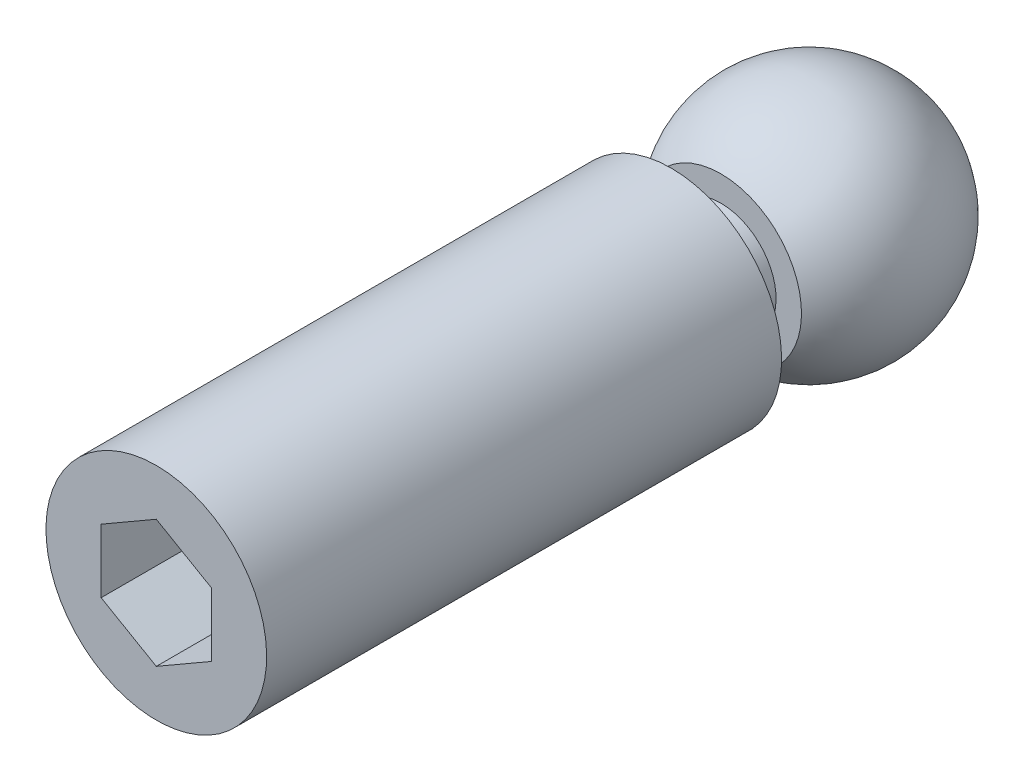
ISO-10303-21;
HEADER;
FILE_DESCRIPTION(('STEP AP214'),'2;1');
FILE_NAME('part.step','',(''),(''),'','','');
FILE_SCHEMA(('AUTOMOTIVE_DESIGN { 1 0 10303 214 1 1 1 1 }'));
ENDSEC;
DATA;
#1=APPLICATION_CONTEXT('core data for automotive mechanical design processes');
#2=APPLICATION_PROTOCOL_DEFINITION('international standard','automotive_design',2000,#1);
#3=PRODUCT_CONTEXT('',#1,'mechanical');
#4=PRODUCT('Part','Part','',(#3));
#5=PRODUCT_RELATED_PRODUCT_CATEGORY('part','',(#4));
#6=PRODUCT_DEFINITION_FORMATION('','',#4);
#7=PRODUCT_DEFINITION_CONTEXT('part definition',#1,'design');
#8=PRODUCT_DEFINITION('design','',#6,#7);
#9=PRODUCT_DEFINITION_SHAPE('','',#8);
#10=(LENGTH_UNIT() NAMED_UNIT(*) SI_UNIT(.MILLI.,.METRE.));
#11=(NAMED_UNIT(*) PLANE_ANGLE_UNIT() SI_UNIT($,.RADIAN.));
#12=(NAMED_UNIT(*) SI_UNIT($,.STERADIAN.) SOLID_ANGLE_UNIT());
#13=UNCERTAINTY_MEASURE_WITH_UNIT(LENGTH_MEASURE(1.E-05),#10,'distance_accuracy_value','');
#14=(GEOMETRIC_REPRESENTATION_CONTEXT(3) GLOBAL_UNCERTAINTY_ASSIGNED_CONTEXT((#13)) GLOBAL_UNIT_ASSIGNED_CONTEXT((#10,
#11,#12)) REPRESENTATION_CONTEXT('',''));
#15=CARTESIAN_POINT('',(0.,0.,0.));
#16=DIRECTION('',(0.,0.,1.));
#17=DIRECTION('',(1.,0.,0.));
#18=AXIS2_PLACEMENT_3D('',#15,#16,#17);
#19=CARTESIAN_POINT('',(0.,0.,6.5));
#20=DIRECTION('',(0.,-1.,0.));
#21=DIRECTION('',(-1.,0.,0.));
#22=AXIS2_PLACEMENT_3D('',#19,#20,#21);
#23=SPHERICAL_SURFACE('',#22,6.5);
#24=CARTESIAN_POINT('',(0.,0.,6.5));
#25=DIRECTION('',(0.,0.,1.));
#26=DIRECTION('',(0.,1.,0.));
#27=AXIS2_PLACEMENT_3D('',#24,#25,#26);
#28=SPHERICAL_SURFACE('',#27,6.5);
#29=CARTESIAN_POINT('',(0.,0.,11.3));
#30=DIRECTION('',(0.,0.,1.));
#31=DIRECTION('',(0.,1.,0.));
#32=AXIS2_PLACEMENT_3D('',#29,#30,#31);
#33=CIRCLE('',#32,4.38292140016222);
#34=CARTESIAN_POINT('',(0.,4.38292140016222,11.3));
#35=VERTEX_POINT('',#34);
#36=EDGE_CURVE('E9',#35,#35,#33,.T.);
#37=ORIENTED_EDGE('',*,*,#36,.F.);
#38=EDGE_LOOP('',(#37));
#39=FACE_BOUND('',#38,.T.);
#40=ADVANCED_FACE('F14',(#39),#28,.T.);
#41=CARTESIAN_POINT('',(0.,-4.38292140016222,11.3));
#42=DIRECTION('',(0.,0.,-1.));
#43=DIRECTION('',(0.,-1.,0.));
#44=AXIS2_PLACEMENT_3D('',#41,#42,#43);
#45=PLANE('',#44);
#46=CARTESIAN_POINT('',(0.,0.,11.3));
#47=DIRECTION('',(0.,0.,1.));
#48=DIRECTION('',(0.,1.,0.));
#49=AXIS2_PLACEMENT_3D('',#46,#47,#48);
#50=CIRCLE('',#49,3.);
#51=CARTESIAN_POINT('',(0.,3.,11.3));
#52=VERTEX_POINT('',#51);
#53=EDGE_CURVE('E21',#52,#52,#50,.T.);
#54=ORIENTED_EDGE('',*,*,#53,.F.);
#55=EDGE_LOOP('',(#54));
#56=FACE_BOUND('',#55,.T.);
#57=ORIENTED_EDGE('',*,*,#36,.T.);
#58=EDGE_LOOP('',(#57));
#59=FACE_BOUND('',#58,.T.);
#60=ADVANCED_FACE('F134',(#56,#59),#45,.F.);
#61=CARTESIAN_POINT('',(0.,0.,8.3));
#62=DIRECTION('',(0.,0.,1.));
#63=DIRECTION('',(0.,1.,0.));
#64=AXIS2_PLACEMENT_3D('',#61,#62,#63);
#65=CYLINDRICAL_SURFACE('',#64,3.);
#66=ORIENTED_EDGE('',*,*,#53,.T.);
#67=EDGE_LOOP('',(#66));
#68=FACE_BOUND('',#67,.T.);
#69=CARTESIAN_POINT('',(0.,0.,14.));
#70=DIRECTION('',(0.,0.,1.));
#71=DIRECTION('',(0.,1.,0.));
#72=AXIS2_PLACEMENT_3D('',#69,#70,#71);
#73=CIRCLE('',#72,3.);
#74=CARTESIAN_POINT('',(0.,3.,14.));
#75=VERTEX_POINT('',#74);
#76=EDGE_CURVE('E126',#75,#75,#73,.T.);
#77=ORIENTED_EDGE('',*,*,#76,.F.);
#78=EDGE_LOOP('',(#77));
#79=FACE_BOUND('',#78,.T.);
#80=ADVANCED_FACE('F131',(#68,#79),#65,.T.);
#81=CARTESIAN_POINT('',(0.,-6.,14.));
#82=DIRECTION('',(0.,0.,-1.));
#83=DIRECTION('',(0.,-1.,0.));
#84=AXIS2_PLACEMENT_3D('',#81,#82,#83);
#85=PLANE('',#84);
#86=ORIENTED_EDGE('',*,*,#76,.T.);
#87=EDGE_LOOP('',(#86));
#88=FACE_BOUND('',#87,.T.);
#89=CARTESIAN_POINT('',(0.,0.,14.));
#90=DIRECTION('',(0.,0.,1.));
#91=DIRECTION('',(0.,1.,0.));
#92=AXIS2_PLACEMENT_3D('',#89,#90,#91);
#93=CIRCLE('',#92,6.);
#94=CARTESIAN_POINT('',(0.,6.,14.));
#95=VERTEX_POINT('',#94);
#96=EDGE_CURVE('E123',#95,#95,#93,.T.);
#97=ORIENTED_EDGE('',*,*,#96,.F.);
#98=EDGE_LOOP('',(#97));
#99=FACE_BOUND('',#98,.T.);
#100=ADVANCED_FACE('F157',(#88,#99),#85,.T.);
#101=CARTESIAN_POINT('',(0.,0.,8.3));
#102=DIRECTION('',(0.,0.,1.));
#103=DIRECTION('',(0.,1.,0.));
#104=AXIS2_PLACEMENT_3D('',#101,#102,#103);
#105=CYLINDRICAL_SURFACE('',#104,6.);
#106=ORIENTED_EDGE('',*,*,#96,.T.);
#107=EDGE_LOOP('',(#106));
#108=FACE_BOUND('',#107,.T.);
#109=CARTESIAN_POINT('',(0.,0.,42.));
#110=DIRECTION('',(0.,0.,1.));
#111=DIRECTION('',(0.,1.,0.));
#112=AXIS2_PLACEMENT_3D('',#109,#110,#111);
#113=CIRCLE('',#112,6.);
#114=CARTESIAN_POINT('',(0.,6.,42.));
#115=VERTEX_POINT('',#114);
#116=EDGE_CURVE('E115',#115,#115,#113,.T.);
#117=ORIENTED_EDGE('',*,*,#116,.F.);
#118=EDGE_LOOP('',(#117));
#119=FACE_BOUND('',#118,.T.);
#120=ADVANCED_FACE('F165',(#108,#119),#105,.T.);
#121=CARTESIAN_POINT('',(0.,0.,42.));
#122=DIRECTION('',(0.,0.,1.));
#123=DIRECTION('',(0.,1.,0.));
#124=AXIS2_PLACEMENT_3D('',#121,#122,#123);
#125=PLANE('',#124);
#126=DIRECTION('',(-0.866025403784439,0.5,0.));
#127=VECTOR('',#126,1.);
#128=CARTESIAN_POINT('',(3.,1.73205080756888,42.));
#129=LINE('',#128,#127);
#130=CARTESIAN_POINT('',(3.,1.73205080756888,42.));
#131=VERTEX_POINT('',#130);
#132=CARTESIAN_POINT('',(0.,3.46410161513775,42.));
#133=VERTEX_POINT('',#132);
#134=EDGE_CURVE('E28',#131,#133,#129,.T.);
#135=ORIENTED_EDGE('',*,*,#134,.F.);
#136=DIRECTION('',(0.,1.,0.));
#137=VECTOR('',#136,1.);
#138=CARTESIAN_POINT('',(3.,-1.73205080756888,42.));
#139=LINE('',#138,#137);
#140=CARTESIAN_POINT('',(3.,-1.73205080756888,42.));
#141=VERTEX_POINT('',#140);
#142=EDGE_CURVE('E111',#141,#131,#139,.T.);
#143=ORIENTED_EDGE('',*,*,#142,.F.);
#144=DIRECTION('',(0.866025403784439,0.5,0.));
#145=VECTOR('',#144,1.);
#146=CARTESIAN_POINT('',(0.,-3.46410161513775,42.));
#147=LINE('',#146,#145);
#148=CARTESIAN_POINT('',(0.,-3.46410161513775,42.));
#149=VERTEX_POINT('',#148);
#150=EDGE_CURVE('E109',#149,#141,#147,.T.);
#151=ORIENTED_EDGE('',*,*,#150,.F.);
#152=DIRECTION('',(0.866025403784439,-0.5,0.));
#153=VECTOR('',#152,1.);
#154=CARTESIAN_POINT('',(-3.,-1.73205080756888,42.));
#155=LINE('',#154,#153);
#156=CARTESIAN_POINT('',(-3.,-1.73205080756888,42.));
#157=VERTEX_POINT('',#156);
#158=EDGE_CURVE('E76',#157,#149,#155,.T.);
#159=ORIENTED_EDGE('',*,*,#158,.F.);
#160=DIRECTION('',(0.,-1.,0.));
#161=VECTOR('',#160,1.);
#162=CARTESIAN_POINT('',(-3.,1.73205080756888,42.));
#163=LINE('',#162,#161);
#164=CARTESIAN_POINT('',(-3.,1.73205080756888,42.));
#165=VERTEX_POINT('',#164);
#166=EDGE_CURVE('E105',#165,#157,#163,.T.);
#167=ORIENTED_EDGE('',*,*,#166,.F.);
#168=DIRECTION('',(-0.866025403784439,-0.5,0.));
#169=VECTOR('',#168,1.);
#170=CARTESIAN_POINT('',(0.,3.46410161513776,42.));
#171=LINE('',#170,#169);
#172=EDGE_CURVE('E102',#133,#165,#171,.T.);
#173=ORIENTED_EDGE('',*,*,#172,.F.);
#174=EDGE_LOOP('',(#135,#143,#151,#159,#167,#173));
#175=FACE_BOUND('',#174,.T.);
#176=ORIENTED_EDGE('',*,*,#116,.T.);
#177=EDGE_LOOP('',(#176));
#178=FACE_BOUND('',#177,.T.);
#179=ADVANCED_FACE('F174',(#175,#178),#125,.T.);
#180=CARTESIAN_POINT('',(3.,1.73205080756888,34.));
#181=DIRECTION('',(0.5,0.866025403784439,0.));
#182=DIRECTION('',(-0.866025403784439,0.5,0.));
#183=AXIS2_PLACEMENT_3D('',#180,#181,#182);
#184=PLANE('',#183);
#185=ORIENTED_EDGE('',*,*,#134,.T.);
#186=DIRECTION('',(0.,0.,1.));
#187=VECTOR('',#186,1.);
#188=CARTESIAN_POINT('',(0.,3.46410161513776,34.));
#189=LINE('',#188,#187);
#190=CARTESIAN_POINT('',(0.,3.46410161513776,34.));
#191=VERTEX_POINT('',#190);
#192=EDGE_CURVE('E58',#191,#133,#189,.T.);
#193=ORIENTED_EDGE('',*,*,#192,.F.);
#194=DIRECTION('',(-0.866025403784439,0.5,0.));
#195=VECTOR('',#194,1.);
#196=CARTESIAN_POINT('',(3.,1.73205080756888,34.));
#197=LINE('',#196,#195);
#198=CARTESIAN_POINT('',(3.,1.73205080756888,34.));
#199=VERTEX_POINT('',#198);
#200=EDGE_CURVE('E113',#199,#191,#197,.T.);
#201=ORIENTED_EDGE('',*,*,#200,.F.);
#202=DIRECTION('',(0.,0.,1.));
#203=VECTOR('',#202,1.);
#204=CARTESIAN_POINT('',(3.,1.73205080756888,34.));
#205=LINE('',#204,#203);
#206=EDGE_CURVE('E36',#199,#131,#205,.T.);
#207=ORIENTED_EDGE('',*,*,#206,.T.);
#208=EDGE_LOOP('',(#185,#193,#201,#207));
#209=FACE_BOUND('',#208,.T.);
#210=ADVANCED_FACE('F183',(#209),#184,.F.);
#211=CARTESIAN_POINT('',(3.,-1.73205080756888,34.));
#212=DIRECTION('',(1.,0.,0.));
#213=DIRECTION('',(0.,0.,-1.));
#214=AXIS2_PLACEMENT_3D('',#211,#212,#213);
#215=PLANE('',#214);
#216=ORIENTED_EDGE('',*,*,#142,.T.);
#217=ORIENTED_EDGE('',*,*,#206,.F.);
#218=DIRECTION('',(0.,1.,0.));
#219=VECTOR('',#218,1.);
#220=CARTESIAN_POINT('',(3.,-1.73205080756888,34.));
#221=LINE('',#220,#219);
#222=CARTESIAN_POINT('',(3.,-1.73205080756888,34.));
#223=VERTEX_POINT('',#222);
#224=EDGE_CURVE('E88',#223,#199,#221,.T.);
#225=ORIENTED_EDGE('',*,*,#224,.F.);
#226=DIRECTION('',(0.,0.,1.));
#227=VECTOR('',#226,1.);
#228=CARTESIAN_POINT('',(3.,-1.73205080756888,34.));
#229=LINE('',#228,#227);
#230=EDGE_CURVE('E80',#223,#141,#229,.T.);
#231=ORIENTED_EDGE('',*,*,#230,.T.);
#232=EDGE_LOOP('',(#216,#217,#225,#231));
#233=FACE_BOUND('',#232,.T.);
#234=ADVANCED_FACE('F192',(#233),#215,.F.);
#235=CARTESIAN_POINT('',(0.,-3.46410161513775,34.));
#236=DIRECTION('',(0.5,-0.866025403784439,0.));
#237=DIRECTION('',(0.866025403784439,0.5,0.));
#238=AXIS2_PLACEMENT_3D('',#235,#236,#237);
#239=PLANE('',#238);
#240=ORIENTED_EDGE('',*,*,#150,.T.);
#241=ORIENTED_EDGE('',*,*,#230,.F.);
#242=DIRECTION('',(0.866025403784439,0.5,0.));
#243=VECTOR('',#242,1.);
#244=CARTESIAN_POINT('',(0.,-3.46410161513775,34.));
#245=LINE('',#244,#243);
#246=CARTESIAN_POINT('',(0.,-3.46410161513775,34.));
#247=VERTEX_POINT('',#246);
#248=EDGE_CURVE('E84',#247,#223,#245,.T.);
#249=ORIENTED_EDGE('',*,*,#248,.F.);
#250=DIRECTION('',(0.,0.,1.));
#251=VECTOR('',#250,1.);
#252=CARTESIAN_POINT('',(0.,-3.46410161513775,34.));
#253=LINE('',#252,#251);
#254=EDGE_CURVE('E69',#247,#149,#253,.T.);
#255=ORIENTED_EDGE('',*,*,#254,.T.);
#256=EDGE_LOOP('',(#240,#241,#249,#255));
#257=FACE_BOUND('',#256,.T.);
#258=ADVANCED_FACE('F85',(#257),#239,.F.);
#259=CARTESIAN_POINT('',(-3.,-1.73205080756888,34.));
#260=DIRECTION('',(-0.5,-0.866025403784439,0.));
#261=DIRECTION('',(0.866025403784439,-0.5,0.));
#262=AXIS2_PLACEMENT_3D('',#259,#260,#261);
#263=PLANE('',#262);
#264=ORIENTED_EDGE('',*,*,#158,.T.);
#265=ORIENTED_EDGE('',*,*,#254,.F.);
#266=DIRECTION('',(0.866025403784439,-0.5,0.));
#267=VECTOR('',#266,1.);
#268=CARTESIAN_POINT('',(-3.,-1.73205080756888,34.));
#269=LINE('',#268,#267);
#270=CARTESIAN_POINT('',(-3.,-1.73205080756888,34.));
#271=VERTEX_POINT('',#270);
#272=EDGE_CURVE('E73',#271,#247,#269,.T.);
#273=ORIENTED_EDGE('',*,*,#272,.F.);
#274=DIRECTION('',(0.,0.,1.));
#275=VECTOR('',#274,1.);
#276=CARTESIAN_POINT('',(-3.,-1.73205080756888,34.));
#277=LINE('',#276,#275);
#278=EDGE_CURVE('E81',#271,#157,#277,.T.);
#279=ORIENTED_EDGE('',*,*,#278,.T.);
#280=EDGE_LOOP('',(#264,#265,#273,#279));
#281=FACE_BOUND('',#280,.T.);
#282=ADVANCED_FACE('F71',(#281),#263,.F.);
#283=CARTESIAN_POINT('',(-3.,1.73205080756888,34.));
#284=DIRECTION('',(-1.,0.,0.));
#285=DIRECTION('',(0.,-1.,0.));
#286=AXIS2_PLACEMENT_3D('',#283,#284,#285);
#287=PLANE('',#286);
#288=ORIENTED_EDGE('',*,*,#166,.T.);
#289=ORIENTED_EDGE('',*,*,#278,.F.);
#290=DIRECTION('',(0.,-1.,0.));
#291=VECTOR('',#290,1.);
#292=CARTESIAN_POINT('',(-3.,1.73205080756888,34.));
#293=LINE('',#292,#291);
#294=CARTESIAN_POINT('',(-3.,1.73205080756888,34.));
#295=VERTEX_POINT('',#294);
#296=EDGE_CURVE('E94',#295,#271,#293,.T.);
#297=ORIENTED_EDGE('',*,*,#296,.F.);
#298=DIRECTION('',(0.,0.,1.));
#299=VECTOR('',#298,1.);
#300=CARTESIAN_POINT('',(-3.,1.73205080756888,34.));
#301=LINE('',#300,#299);
#302=EDGE_CURVE('E118',#295,#165,#301,.T.);
#303=ORIENTED_EDGE('',*,*,#302,.T.);
#304=EDGE_LOOP('',(#288,#289,#297,#303));
#305=FACE_BOUND('',#304,.T.);
#306=ADVANCED_FACE('F214',(#305),#287,.F.);
#307=CARTESIAN_POINT('',(0.,3.46410161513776,34.));
#308=DIRECTION('',(-0.5,0.866025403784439,0.));
#309=DIRECTION('',(-0.866025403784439,-0.5,0.));
#310=AXIS2_PLACEMENT_3D('',#307,#308,#309);
#311=PLANE('',#310);
#312=ORIENTED_EDGE('',*,*,#172,.T.);
#313=ORIENTED_EDGE('',*,*,#302,.F.);
#314=DIRECTION('',(-0.866025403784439,-0.5,0.));
#315=VECTOR('',#314,1.);
#316=CARTESIAN_POINT('',(0.,3.46410161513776,34.));
#317=LINE('',#316,#315);
#318=EDGE_CURVE('E96',#191,#295,#317,.T.);
#319=ORIENTED_EDGE('',*,*,#318,.F.);
#320=ORIENTED_EDGE('',*,*,#192,.T.);
#321=EDGE_LOOP('',(#312,#313,#319,#320));
#322=FACE_BOUND('',#321,.T.);
#323=ADVANCED_FACE('F222',(#322),#311,.F.);
#324=CARTESIAN_POINT('',(0.,3.46410161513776,34.));
#325=DIRECTION('',(0.,0.,1.));
#326=DIRECTION('',(1.,0.,0.));
#327=AXIS2_PLACEMENT_3D('',#324,#325,#326);
#328=PLANE('',#327);
#329=ORIENTED_EDGE('',*,*,#200,.T.);
#330=ORIENTED_EDGE('',*,*,#318,.T.);
#331=ORIENTED_EDGE('',*,*,#296,.T.);
#332=ORIENTED_EDGE('',*,*,#272,.T.);
#333=ORIENTED_EDGE('',*,*,#248,.T.);
#334=ORIENTED_EDGE('',*,*,#224,.T.);
#335=EDGE_LOOP('',(#329,#330,#331,#332,#333,#334));
#336=FACE_BOUND('',#335,.T.);
#337=ADVANCED_FACE('F91',(#336),#328,.T.);
#338=CLOSED_SHELL('',(#40,#60,#80,#100,#120,#179,#210,#234,#258,#282,#306,#323,#337));
#339=MANIFOLD_SOLID_BREP('B1',#338);
#340=ADVANCED_BREP_SHAPE_REPRESENTATION('',(#18,#339),#14);
#341=SHAPE_DEFINITION_REPRESENTATION(#9,#340);
ENDSEC;
END-ISO-10303-21;
